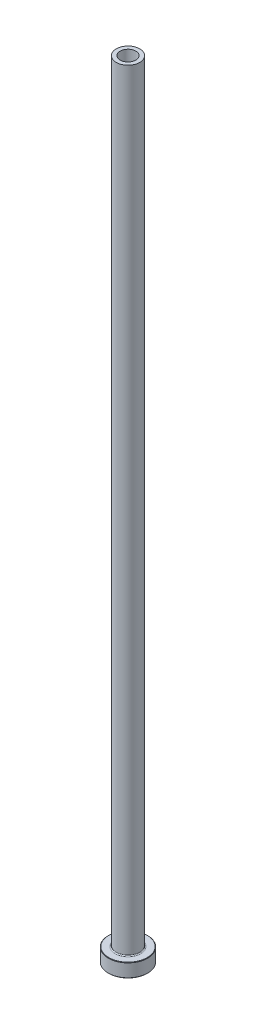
ISO-10303-21;
HEADER;
FILE_DESCRIPTION(('STEP AP214'),'2;1');
FILE_NAME('part.step','',(''),(''),'','','');
FILE_SCHEMA(('AUTOMOTIVE_DESIGN { 1 0 10303 214 1 1 1 1 }'));
ENDSEC;
DATA;
#1=APPLICATION_CONTEXT('core data for automotive mechanical design processes');
#2=APPLICATION_PROTOCOL_DEFINITION('international standard','automotive_design',2000,#1);
#3=PRODUCT_CONTEXT('',#1,'mechanical');
#4=PRODUCT('Part','Part','',(#3));
#5=PRODUCT_RELATED_PRODUCT_CATEGORY('part','',(#4));
#6=PRODUCT_DEFINITION_FORMATION('','',#4);
#7=PRODUCT_DEFINITION_CONTEXT('part definition',#1,'design');
#8=PRODUCT_DEFINITION('design','',#6,#7);
#9=PRODUCT_DEFINITION_SHAPE('','',#8);
#10=(LENGTH_UNIT() NAMED_UNIT(*) SI_UNIT(.MILLI.,.METRE.));
#11=(NAMED_UNIT(*) PLANE_ANGLE_UNIT() SI_UNIT($,.RADIAN.));
#12=(NAMED_UNIT(*) SI_UNIT($,.STERADIAN.) SOLID_ANGLE_UNIT());
#13=UNCERTAINTY_MEASURE_WITH_UNIT(LENGTH_MEASURE(1.E-05),#10,'distance_accuracy_value','');
#14=(GEOMETRIC_REPRESENTATION_CONTEXT(3) GLOBAL_UNCERTAINTY_ASSIGNED_CONTEXT((#13)) GLOBAL_UNIT_ASSIGNED_CONTEXT((#10,
#11,#12)) REPRESENTATION_CONTEXT('',''));
#15=CARTESIAN_POINT('',(0.,0.,0.));
#16=DIRECTION('',(0.,0.,1.));
#17=DIRECTION('',(1.,0.,0.));
#18=AXIS2_PLACEMENT_3D('',#15,#16,#17);
#19=CARTESIAN_POINT('',(0.,92.1876809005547,0.));
#20=DIRECTION('',(0.,1.,0.));
#21=DIRECTION('',(0.,0.,1.));
#22=AXIS2_PLACEMENT_3D('',#19,#20,#21);
#23=CYLINDRICAL_SURFACE('',#22,4.00000000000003);
#24=CARTESIAN_POINT('',(0.,400.,0.));
#25=DIRECTION('',(0.,1.,0.));
#26=DIRECTION('',(0.,0.,1.));
#27=AXIS2_PLACEMENT_3D('',#24,#25,#26);
#28=CIRCLE('',#27,4.00000000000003);
#29=CARTESIAN_POINT('',(0.,400.,4.00000000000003));
#30=VERTEX_POINT('',#29);
#31=EDGE_CURVE('E62',#30,#30,#28,.T.);
#32=ORIENTED_EDGE('',*,*,#31,.T.);
#33=EDGE_LOOP('',(#32));
#34=FACE_BOUND('',#33,.T.);
#35=CARTESIAN_POINT('',(0.,355.,0.));
#36=DIRECTION('',(0.,1.,0.));
#37=DIRECTION('',(0.,0.,1.));
#38=AXIS2_PLACEMENT_3D('',#35,#36,#37);
#39=CIRCLE('',#38,4.00000000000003);
#40=CARTESIAN_POINT('',(0.,355.,4.00000000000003));
#41=VERTEX_POINT('',#40);
#42=EDGE_CURVE('E71',#41,#41,#39,.T.);
#43=ORIENTED_EDGE('',*,*,#42,.F.);
#44=EDGE_LOOP('',(#43));
#45=FACE_BOUND('',#44,.T.);
#46=ADVANCED_FACE('F30',(#34,#45),#23,.F.);
#47=CARTESIAN_POINT('',(-4.00000000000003,400.,0.));
#48=DIRECTION('',(0.,1.,0.));
#49=DIRECTION('',(0.,0.,1.));
#50=AXIS2_PLACEMENT_3D('',#47,#48,#49);
#51=PLANE('',#50);
#52=CARTESIAN_POINT('',(0.,400.,0.));
#53=DIRECTION('',(0.,1.,0.));
#54=DIRECTION('',(0.,0.,1.));
#55=AXIS2_PLACEMENT_3D('',#52,#53,#54);
#56=CIRCLE('',#55,6.00000000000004);
#57=CARTESIAN_POINT('',(0.,400.,6.00000000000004));
#58=VERTEX_POINT('',#57);
#59=EDGE_CURVE('E65',#58,#58,#56,.T.);
#60=ORIENTED_EDGE('',*,*,#59,.T.);
#61=EDGE_LOOP('',(#60));
#62=FACE_BOUND('',#61,.T.);
#63=ORIENTED_EDGE('',*,*,#31,.F.);
#64=EDGE_LOOP('',(#63));
#65=FACE_BOUND('',#64,.T.);
#66=ADVANCED_FACE('F79',(#62,#65),#51,.T.);
#67=CARTESIAN_POINT('',(0.,92.1876809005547,0.));
#68=DIRECTION('',(0.,1.,0.));
#69=DIRECTION('',(0.,0.,1.));
#70=AXIS2_PLACEMENT_3D('',#67,#68,#69);
#71=CYLINDRICAL_SURFACE('',#70,6.00000000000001);
#72=CARTESIAN_POINT('',(0.,7.50000000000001,0.));
#73=DIRECTION('',(0.,1.,0.));
#74=DIRECTION('',(0.,0.,1.));
#75=AXIS2_PLACEMENT_3D('',#72,#73,#74);
#76=CIRCLE('',#75,6.00000000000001);
#77=CARTESIAN_POINT('',(0.,7.50000000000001,6.00000000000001));
#78=VERTEX_POINT('',#77);
#79=EDGE_CURVE('E59',#78,#78,#76,.T.);
#80=ORIENTED_EDGE('',*,*,#79,.T.);
#81=EDGE_LOOP('',(#80));
#82=FACE_BOUND('',#81,.T.);
#83=ORIENTED_EDGE('',*,*,#59,.F.);
#84=EDGE_LOOP('',(#83));
#85=FACE_BOUND('',#84,.T.);
#86=ADVANCED_FACE('F85',(#82,#85),#71,.T.);
#87=CARTESIAN_POINT('',(-5.99999999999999,7.,0.));
#88=DIRECTION('',(0.,1.,0.));
#89=DIRECTION('',(0.,0.,1.));
#90=AXIS2_PLACEMENT_3D('',#87,#88,#89);
#91=PLANE('',#90);
#92=CARTESIAN_POINT('',(0.,7.,0.));
#93=DIRECTION('',(0.,1.,0.));
#94=DIRECTION('',(0.,0.,1.));
#95=AXIS2_PLACEMENT_3D('',#92,#93,#94);
#96=CIRCLE('',#95,9.80000000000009);
#97=CARTESIAN_POINT('',(0.,7.,9.80000000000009));
#98=VERTEX_POINT('',#97);
#99=EDGE_CURVE('E53',#98,#98,#96,.T.);
#100=ORIENTED_EDGE('',*,*,#99,.T.);
#101=EDGE_LOOP('',(#100));
#102=FACE_BOUND('',#101,.T.);
#103=CARTESIAN_POINT('',(0.,7.,0.));
#104=DIRECTION('',(0.,1.,0.));
#105=DIRECTION('',(0.,0.,1.));
#106=AXIS2_PLACEMENT_3D('',#103,#104,#105);
#107=CIRCLE('',#106,6.50000000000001);
#108=CARTESIAN_POINT('',(0.,7.,6.50000000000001));
#109=VERTEX_POINT('',#108);
#110=EDGE_CURVE('E56',#109,#109,#107,.F.);
#111=ORIENTED_EDGE('',*,*,#110,.T.);
#112=EDGE_LOOP('',(#111));
#113=FACE_BOUND('',#112,.T.);
#114=ADVANCED_FACE('F111',(#102,#113),#91,.T.);
#115=CARTESIAN_POINT('',(0.,92.1876809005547,0.));
#116=DIRECTION('',(0.,1.,0.));
#117=DIRECTION('',(0.,0.,1.));
#118=AXIS2_PLACEMENT_3D('',#115,#116,#117);
#119=CYLINDRICAL_SURFACE('',#118,9.99999999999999);
#120=CARTESIAN_POINT('',(0.,6.80000000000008,0.));
#121=DIRECTION('',(0.,1.,0.));
#122=DIRECTION('',(0.,0.,1.));
#123=AXIS2_PLACEMENT_3D('',#120,#121,#122);
#124=CIRCLE('',#123,9.99999999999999);
#125=CARTESIAN_POINT('',(0.,6.80000000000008,9.99999999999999));
#126=VERTEX_POINT('',#125);
#127=EDGE_CURVE('E45',#126,#126,#124,.F.);
#128=CARTESIAN_POINT('',(0.,0.199999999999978,0.));
#129=DIRECTION('',(0.,-1.,0.));
#130=DIRECTION('',(0.,0.,-1.));
#131=AXIS2_PLACEMENT_3D('',#128,#129,#130);
#132=CIRCLE('',#131,9.99999999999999);
#133=CARTESIAN_POINT('',(0.,0.199999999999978,9.99999999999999));
#134=VERTEX_POINT('',#133);
#135=EDGE_CURVE('E50',#134,#134,#132,.F.);
#136=CARTESIAN_POINT('',(0.,6.80000000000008,9.99999999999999));
#137=CARTESIAN_POINT('',(0.,6.73125000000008,9.99999999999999));
#138=CARTESIAN_POINT('',(0.,6.66250000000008,9.99999999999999));
#139=CARTESIAN_POINT('',(0.,6.52500000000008,9.99999999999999));
#140=CARTESIAN_POINT('',(0.,6.45625000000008,9.99999999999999));
#141=CARTESIAN_POINT('',(0.,6.31875000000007,9.99999999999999));
#142=CARTESIAN_POINT('',(0.,6.25000000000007,9.99999999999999));
#143=CARTESIAN_POINT('',(0.,6.11250000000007,9.99999999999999));
#144=CARTESIAN_POINT('',(0.,6.04375000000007,9.99999999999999));
#145=CARTESIAN_POINT('',(0.,5.90625000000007,9.99999999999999));
#146=CARTESIAN_POINT('',(0.,5.83750000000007,9.99999999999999));
#147=CARTESIAN_POINT('',(0.,5.70000000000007,9.99999999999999));
#148=CARTESIAN_POINT('',(0.,5.63125000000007,9.99999999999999));
#149=CARTESIAN_POINT('',(0.,5.49375000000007,9.99999999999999));
#150=CARTESIAN_POINT('',(0.,5.42500000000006,9.99999999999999));
#151=CARTESIAN_POINT('',(0.,5.28750000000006,9.99999999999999));
#152=CARTESIAN_POINT('',(0.,5.21875000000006,9.99999999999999));
#153=CARTESIAN_POINT('',(0.,5.08125000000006,9.99999999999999));
#154=CARTESIAN_POINT('',(0.,5.01250000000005,9.99999999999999));
#155=CARTESIAN_POINT('',(0.,4.87500000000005,9.99999999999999));
#156=CARTESIAN_POINT('',(0.,4.80625000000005,9.99999999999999));
#157=CARTESIAN_POINT('',(0.,4.66875000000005,9.99999999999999));
#158=CARTESIAN_POINT('',(0.,4.60000000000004,9.99999999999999));
#159=CARTESIAN_POINT('',(0.,4.46250000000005,9.99999999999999));
#160=CARTESIAN_POINT('',(0.,4.39375000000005,9.99999999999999));
#161=CARTESIAN_POINT('',(0.,4.25625000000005,9.99999999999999));
#162=CARTESIAN_POINT('',(0.,4.18750000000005,9.99999999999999));
#163=CARTESIAN_POINT('',(0.,4.05000000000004,9.99999999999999));
#164=CARTESIAN_POINT('',(0.,3.98125000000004,9.99999999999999));
#165=CARTESIAN_POINT('',(0.,3.84375000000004,9.99999999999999));
#166=CARTESIAN_POINT('',(0.,3.77500000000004,9.99999999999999));
#167=CARTESIAN_POINT('',(0.,3.63750000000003,9.99999999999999));
#168=CARTESIAN_POINT('',(0.,3.56875000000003,9.99999999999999));
#169=CARTESIAN_POINT('',(0.,3.43125000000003,9.99999999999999));
#170=CARTESIAN_POINT('',(0.,3.36250000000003,9.99999999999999));
#171=CARTESIAN_POINT('',(0.,3.22500000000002,9.99999999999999));
#172=CARTESIAN_POINT('',(0.,3.15625000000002,9.99999999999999));
#173=CARTESIAN_POINT('',(0.,3.01875000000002,9.99999999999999));
#174=CARTESIAN_POINT('',(0.,2.95000000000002,9.99999999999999));
#175=CARTESIAN_POINT('',(0.,2.81250000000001,9.99999999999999));
#176=CARTESIAN_POINT('',(0.,2.74375000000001,9.99999999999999));
#177=CARTESIAN_POINT('',(0.,2.60625000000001,9.99999999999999));
#178=CARTESIAN_POINT('',(0.,2.53750000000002,9.99999999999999));
#179=CARTESIAN_POINT('',(0.,2.40000000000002,9.99999999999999));
#180=CARTESIAN_POINT('',(0.,2.33125000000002,9.99999999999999));
#181=CARTESIAN_POINT('',(0.,2.19375000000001,9.99999999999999));
#182=CARTESIAN_POINT('',(0.,2.12500000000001,9.99999999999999));
#183=CARTESIAN_POINT('',(0.,1.98750000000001,9.99999999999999));
#184=CARTESIAN_POINT('',(0.,1.91875000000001,9.99999999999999));
#185=CARTESIAN_POINT('',(0.,1.78125,9.99999999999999));
#186=CARTESIAN_POINT('',(0.,1.7125,9.99999999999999));
#187=CARTESIAN_POINT('',(0.,1.575,9.99999999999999));
#188=CARTESIAN_POINT('',(0.,1.50625,9.99999999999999));
#189=CARTESIAN_POINT('',(0.,1.36874999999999,9.99999999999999));
#190=CARTESIAN_POINT('',(0.,1.29999999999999,9.99999999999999));
#191=CARTESIAN_POINT('',(0.,1.16249999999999,9.99999999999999));
#192=CARTESIAN_POINT('',(0.,1.09375,9.99999999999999));
#193=CARTESIAN_POINT('',(0.,0.956249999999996,9.99999999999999));
#194=CARTESIAN_POINT('',(0.,0.887499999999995,9.99999999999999));
#195=CARTESIAN_POINT('',(0.,0.749999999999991,9.99999999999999));
#196=CARTESIAN_POINT('',(0.,0.68124999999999,9.99999999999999));
#197=CARTESIAN_POINT('',(0.,0.543749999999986,9.99999999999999));
#198=CARTESIAN_POINT('',(0.,0.474999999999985,9.99999999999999));
#199=CARTESIAN_POINT('',(0.,0.337499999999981,9.99999999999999));
#200=CARTESIAN_POINT('',(0.,0.26874999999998,9.99999999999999));
#201=CARTESIAN_POINT('',(0.,0.199999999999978,9.99999999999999));
#202=B_SPLINE_CURVE_WITH_KNOTS('',3,(#136,#137,#138,#139,#140,#141,#142,#143,#144,#145,#146,
#147,#148,#149,#150,#151,#152,#153,#154,#155,#156,#157,#158,#159,#160,#161,#162,#163,#164,#165,
#166,#167,#168,#169,#170,#171,#172,#173,#174,#175,#176,#177,#178,#179,#180,#181,#182,#183,#184,
#185,#186,#187,#188,#189,#190,#191,#192,#193,#194,#195,#196,#197,#198,#199,#200,#201),
.UNSPECIFIED.,.F.,.F.,(4,2,2,2,2,2,2,2,2,2,2,2,2,2,2,2,2,2,2,2,2,2,2,2,2,2,2,2,2,2,2,2,4),(0.,
0.206250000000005,0.41250000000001,0.618750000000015,0.82500000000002,1.03125000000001,
1.23750000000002,1.44375000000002,1.65000000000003,1.85625000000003,2.06250000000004,
2.26875000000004,2.47500000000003,2.68125000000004,2.88750000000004,3.09375000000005,
3.30000000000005,3.50625000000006,3.71250000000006,3.91875000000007,4.12500000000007,
4.33125000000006,4.53750000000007,4.74375000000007,4.95000000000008,5.15625000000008,
5.36250000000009,5.56875000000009,5.77500000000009,5.98125000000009,6.1875000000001,
6.3937500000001,6.60000000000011),.UNSPECIFIED.);
#203=EDGE_CURVE('BSEAM108',#126,#134,#202,.T.);
#204=ORIENTED_EDGE('',*,*,#127,.T.);
#205=ORIENTED_EDGE('',*,*,#135,.T.);
#206=ORIENTED_EDGE('',*,*,#203,.T.);
#207=ORIENTED_EDGE('',*,*,#203,.F.);
#208=EDGE_LOOP('',(#204,#206,#205,#207));
#209=FACE_BOUND('',#208,.T.);
#210=ADVANCED_FACE('F108',(#209),#119,.T.);
#211=CARTESIAN_POINT('',(-9.99999999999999,0.,0.));
#212=DIRECTION('',(0.,-1.,0.));
#213=DIRECTION('',(0.,0.,-1.));
#214=AXIS2_PLACEMENT_3D('',#211,#212,#213);
#215=PLANE('',#214);
#216=CARTESIAN_POINT('',(0.,0.,0.));
#217=DIRECTION('',(0.,-1.,0.));
#218=DIRECTION('',(0.,0.,-1.));
#219=AXIS2_PLACEMENT_3D('',#216,#217,#218);
#220=CIRCLE('',#219,4.74999999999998);
#221=CARTESIAN_POINT('',(0.,0.,-4.74999999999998));
#222=VERTEX_POINT('',#221);
#223=EDGE_CURVE('E37',#222,#222,#220,.F.);
#224=ORIENTED_EDGE('',*,*,#223,.T.);
#225=EDGE_LOOP('',(#224));
#226=FACE_BOUND('',#225,.T.);
#227=CARTESIAN_POINT('',(0.,0.,0.));
#228=DIRECTION('',(0.,-1.,0.));
#229=DIRECTION('',(0.,0.,-1.));
#230=AXIS2_PLACEMENT_3D('',#227,#228,#229);
#231=CIRCLE('',#230,9.80000000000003);
#232=CARTESIAN_POINT('',(0.,0.,9.80000000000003));
#233=VERTEX_POINT('',#232);
#234=EDGE_CURVE('E41',#233,#233,#231,.T.);
#235=ORIENTED_EDGE('',*,*,#234,.T.);
#236=EDGE_LOOP('',(#235));
#237=FACE_BOUND('',#236,.T.);
#238=ADVANCED_FACE('F110',(#226,#237),#215,.T.);
#239=CARTESIAN_POINT('',(0.,92.1876809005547,0.));
#240=DIRECTION('',(0.,1.,0.));
#241=DIRECTION('',(0.,0.,1.));
#242=AXIS2_PLACEMENT_3D('',#239,#240,#241);
#243=CYLINDRICAL_SURFACE('',#242,4.25000000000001);
#244=CARTESIAN_POINT('',(0.,0.5,0.));
#245=DIRECTION('',(0.,-1.,0.));
#246=DIRECTION('',(0.,0.,-1.));
#247=AXIS2_PLACEMENT_3D('',#244,#245,#246);
#248=CIRCLE('',#247,4.25000000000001);
#249=CARTESIAN_POINT('',(0.,0.5,-4.25000000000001));
#250=VERTEX_POINT('',#249);
#251=EDGE_CURVE('E10',#250,#250,#248,.T.);
#252=ORIENTED_EDGE('',*,*,#251,.T.);
#253=EDGE_LOOP('',(#252));
#254=FACE_BOUND('',#253,.T.);
#255=CARTESIAN_POINT('',(0.,343.,0.));
#256=DIRECTION('',(0.,1.,0.));
#257=DIRECTION('',(0.,0.,1.));
#258=AXIS2_PLACEMENT_3D('',#255,#256,#257);
#259=CIRCLE('',#258,4.25000000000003);
#260=CARTESIAN_POINT('',(0.,343.,4.25000000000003));
#261=VERTEX_POINT('',#260);
#262=EDGE_CURVE('E68',#261,#261,#259,.T.);
#263=ORIENTED_EDGE('',*,*,#262,.T.);
#264=EDGE_LOOP('',(#263));
#265=FACE_BOUND('',#264,.T.);
#266=ADVANCED_FACE('F118',(#254,#265),#243,.F.);
#267=CARTESIAN_POINT('',(0.,343.,0.));
#268=DIRECTION('',(0.,-1.,0.));
#269=DIRECTION('',(0.,0.,-1.));
#270=AXIS2_PLACEMENT_3D('',#267,#268,#269);
#271=CONICAL_SURFACE('',#270,4.25000000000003,0.0208303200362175);
#272=ORIENTED_EDGE('',*,*,#42,.T.);
#273=EDGE_LOOP('',(#272));
#274=FACE_BOUND('',#273,.T.);
#275=ORIENTED_EDGE('',*,*,#262,.F.);
#276=EDGE_LOOP('',(#275));
#277=FACE_BOUND('',#276,.T.);
#278=ADVANCED_FACE('F75',(#274,#277),#271,.F.);
#279=CARTESIAN_POINT('',(0.,7.50000000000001,0.));
#280=DIRECTION('',(0.,1.,0.));
#281=DIRECTION('',(0.,0.,1.));
#282=AXIS2_PLACEMENT_3D('',#279,#280,#281);
#283=TOROIDAL_SURFACE('',#282,6.50000000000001,0.5);
#284=ORIENTED_EDGE('',*,*,#110,.F.);
#285=EDGE_LOOP('',(#284));
#286=FACE_BOUND('',#285,.T.);
#287=ORIENTED_EDGE('',*,*,#79,.F.);
#288=EDGE_LOOP('',(#287));
#289=FACE_BOUND('',#288,.T.);
#290=ADVANCED_FACE('F90',(#286,#289),#283,.F.);
#291=CARTESIAN_POINT('',(0.,7.00000000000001,0.));
#292=DIRECTION('',(0.,-1.,0.));
#293=DIRECTION('',(0.,0.,-1.));
#294=AXIS2_PLACEMENT_3D('',#291,#292,#293);
#295=CONICAL_SURFACE('',#294,9.80000000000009,0.785398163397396);
#296=ORIENTED_EDGE('',*,*,#127,.F.);
#297=EDGE_LOOP('',(#296));
#298=FACE_BOUND('',#297,.T.);
#299=ORIENTED_EDGE('',*,*,#99,.F.);
#300=EDGE_LOOP('',(#299));
#301=FACE_BOUND('',#300,.T.);
#302=ADVANCED_FACE('F93',(#298,#301),#295,.T.);
#303=CARTESIAN_POINT('',(0.,0.199999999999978,0.));
#304=DIRECTION('',(0.,1.,0.));
#305=DIRECTION('',(0.,0.,1.));
#306=AXIS2_PLACEMENT_3D('',#303,#304,#305);
#307=CONICAL_SURFACE('',#306,9.99999999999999,0.785398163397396);
#308=CARTESIAN_POINT('',(0.,0.,9.80000000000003));
#309=CARTESIAN_POINT('',(0.,0.00208333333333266,9.80208333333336));
#310=CARTESIAN_POINT('',(0.,0.00416666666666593,9.8041666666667));
#311=CARTESIAN_POINT('',(0.,0.00833333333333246,9.80833333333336));
#312=CARTESIAN_POINT('',(0.,0.0104166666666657,9.8104166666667));
#313=CARTESIAN_POINT('',(0.,0.0145833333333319,9.81458333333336));
#314=CARTESIAN_POINT('',(0.,0.0166666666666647,9.81666666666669));
#315=CARTESIAN_POINT('',(0.,0.0208333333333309,9.82083333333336));
#316=CARTESIAN_POINT('',(0.,0.0229166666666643,9.82291666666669));
#317=CARTESIAN_POINT('',(0.,0.0270833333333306,9.82708333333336));
#318=CARTESIAN_POINT('',(0.,0.0291666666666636,9.82916666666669));
#319=CARTESIAN_POINT('',(0.,0.0333333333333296,9.83333333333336));
#320=CARTESIAN_POINT('',(0.,0.0354166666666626,9.83541666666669));
#321=CARTESIAN_POINT('',(0.,0.0395833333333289,9.83958333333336));
#322=CARTESIAN_POINT('',(0.,0.0416666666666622,9.84166666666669));
#323=CARTESIAN_POINT('',(0.,0.0458333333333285,9.84583333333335));
#324=CARTESIAN_POINT('',(0.,0.0479166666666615,9.84791666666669));
#325=CARTESIAN_POINT('',(0.,0.0520833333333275,9.85208333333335));
#326=CARTESIAN_POINT('',(0.,0.0541666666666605,9.85416666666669));
#327=CARTESIAN_POINT('',(0.,0.0583333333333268,9.85833333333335));
#328=CARTESIAN_POINT('',(0.,0.0604166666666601,9.86041666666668));
#329=CARTESIAN_POINT('',(0.,0.0645833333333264,9.86458333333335));
#330=CARTESIAN_POINT('',(0.,0.0666666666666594,9.86666666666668));
#331=CARTESIAN_POINT('',(0.,0.0708333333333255,9.87083333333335));
#332=CARTESIAN_POINT('',(0.,0.0729166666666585,9.87291666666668));
#333=CARTESIAN_POINT('',(0.,0.0770833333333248,9.87708333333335));
#334=CARTESIAN_POINT('',(0.,0.0791666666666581,9.87916666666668));
#335=CARTESIAN_POINT('',(0.,0.0833333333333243,9.88333333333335));
#336=CARTESIAN_POINT('',(0.,0.0854166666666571,9.88541666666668));
#337=CARTESIAN_POINT('',(0.,0.0895833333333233,9.88958333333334));
#338=CARTESIAN_POINT('',(0.,0.0916666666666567,9.89166666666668));
#339=CARTESIAN_POINT('',(0.,0.095833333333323,9.89583333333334));
#340=CARTESIAN_POINT('',(0.,0.097916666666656,9.89791666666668));
#341=CARTESIAN_POINT('',(0.,0.102083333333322,9.90208333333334));
#342=CARTESIAN_POINT('',(0.,0.104166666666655,9.90416666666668));
#343=CARTESIAN_POINT('',(0.,0.108333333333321,9.90833333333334));
#344=CARTESIAN_POINT('',(0.,0.110416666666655,9.91041666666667));
#345=CARTESIAN_POINT('',(0.,0.114583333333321,9.91458333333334));
#346=CARTESIAN_POINT('',(0.,0.116666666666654,9.91666666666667));
#347=CARTESIAN_POINT('',(0.,0.12083333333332,9.92083333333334));
#348=CARTESIAN_POINT('',(0.,0.122916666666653,9.92291666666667));
#349=CARTESIAN_POINT('',(0.,0.127083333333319,9.92708333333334));
#350=CARTESIAN_POINT('',(0.,0.129166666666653,9.92916666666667));
#351=CARTESIAN_POINT('',(0.,0.133333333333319,9.93333333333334));
#352=CARTESIAN_POINT('',(0.,0.135416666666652,9.93541666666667));
#353=CARTESIAN_POINT('',(0.,0.139583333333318,9.93958333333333));
#354=CARTESIAN_POINT('',(0.,0.141666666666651,9.94166666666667));
#355=CARTESIAN_POINT('',(0.,0.145833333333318,9.94583333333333));
#356=CARTESIAN_POINT('',(0.,0.147916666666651,9.94791666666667));
#357=CARTESIAN_POINT('',(0.,0.152083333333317,9.95208333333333));
#358=CARTESIAN_POINT('',(0.,0.15416666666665,9.95416666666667));
#359=CARTESIAN_POINT('',(0.,0.158333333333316,9.95833333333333));
#360=CARTESIAN_POINT('',(0.,0.160416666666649,9.96041666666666));
#361=CARTESIAN_POINT('',(0.,0.164583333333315,9.96458333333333));
#362=CARTESIAN_POINT('',(0.,0.166666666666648,9.96666666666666));
#363=CARTESIAN_POINT('',(0.,0.170833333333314,9.97083333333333));
#364=CARTESIAN_POINT('',(0.,0.172916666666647,9.97291666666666));
#365=CARTESIAN_POINT('',(0.,0.177083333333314,9.97708333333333));
#366=CARTESIAN_POINT('',(0.,0.179166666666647,9.97916666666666));
#367=CARTESIAN_POINT('',(0.,0.183333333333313,9.98333333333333));
#368=CARTESIAN_POINT('',(0.,0.185416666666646,9.98541666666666));
#369=CARTESIAN_POINT('',(0.,0.189583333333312,9.98958333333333));
#370=CARTESIAN_POINT('',(0.,0.191666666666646,9.99166666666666));
#371=CARTESIAN_POINT('',(0.,0.195833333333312,9.99583333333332));
#372=CARTESIAN_POINT('',(0.,0.197916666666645,9.99791666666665));
#373=CARTESIAN_POINT('',(0.,0.199999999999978,9.99999999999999));
#374=B_SPLINE_CURVE_WITH_KNOTS('',3,(#308,#309,#310,#311,#312,#313,#314,#315,#316,#317,#318,
#319,#320,#321,#322,#323,#324,#325,#326,#327,#328,#329,#330,#331,#332,#333,#334,#335,#336,#337,
#338,#339,#340,#341,#342,#343,#344,#345,#346,#347,#348,#349,#350,#351,#352,#353,#354,#355,#356,
#357,#358,#359,#360,#361,#362,#363,#364,#365,#366,#367,#368,#369,#370,#371,#372,#373),
.UNSPECIFIED.,.F.,.F.,(4,2,2,2,2,2,2,2,2,2,2,2,2,2,2,2,2,2,2,2,2,2,2,2,2,2,2,2,2,2,2,2,4),(0.,
0.00883883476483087,0.0176776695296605,0.0265165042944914,0.035355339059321,0.0441941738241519,
0.0530330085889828,0.0618718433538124,0.0707106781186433,0.0795495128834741,0.0883883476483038,
0.0972271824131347,0.106066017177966,0.114904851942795,0.123743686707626,0.132582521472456,
0.141421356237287,0.150260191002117,0.159099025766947,0.167937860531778,0.176776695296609,
0.185615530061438,0.194454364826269,0.203293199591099,0.21213203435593,0.220970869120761,
0.22980970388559,0.238648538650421,0.247487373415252,0.256326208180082,0.265165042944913,
0.274003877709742,0.282842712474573),.UNSPECIFIED.);
#375=EDGE_CURVE('BSEAM96',#233,#134,#374,.T.);
#376=ORIENTED_EDGE('',*,*,#234,.F.);
#377=ORIENTED_EDGE('',*,*,#135,.F.);
#378=ORIENTED_EDGE('',*,*,#375,.T.);
#379=ORIENTED_EDGE('',*,*,#375,.F.);
#380=EDGE_LOOP('',(#376,#378,#377,#379));
#381=FACE_BOUND('',#380,.T.);
#382=ADVANCED_FACE('F96',(#381),#307,.T.);
#383=CARTESIAN_POINT('',(0.,0.,0.));
#384=DIRECTION('',(0.,-1.,0.));
#385=DIRECTION('',(0.,0.,-1.));
#386=AXIS2_PLACEMENT_3D('',#383,#384,#385);
#387=CONICAL_SURFACE('',#386,4.74999999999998,0.785398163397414);
#388=ORIENTED_EDGE('',*,*,#251,.F.);
#389=EDGE_LOOP('',(#388));
#390=FACE_BOUND('',#389,.T.);
#391=ORIENTED_EDGE('',*,*,#223,.F.);
#392=EDGE_LOOP('',(#391));
#393=FACE_BOUND('',#392,.T.);
#394=ADVANCED_FACE('F32',(#390,#393),#387,.F.);
#395=CLOSED_SHELL('',(#46,#66,#86,#114,#210,#238,#266,#278,#290,#302,#382,#394));
#396=MANIFOLD_SOLID_BREP('B2',#395);
#397=ADVANCED_BREP_SHAPE_REPRESENTATION('',(#18,#396),#14);
#398=SHAPE_DEFINITION_REPRESENTATION(#9,#397);
ENDSEC;
END-ISO-10303-21;
